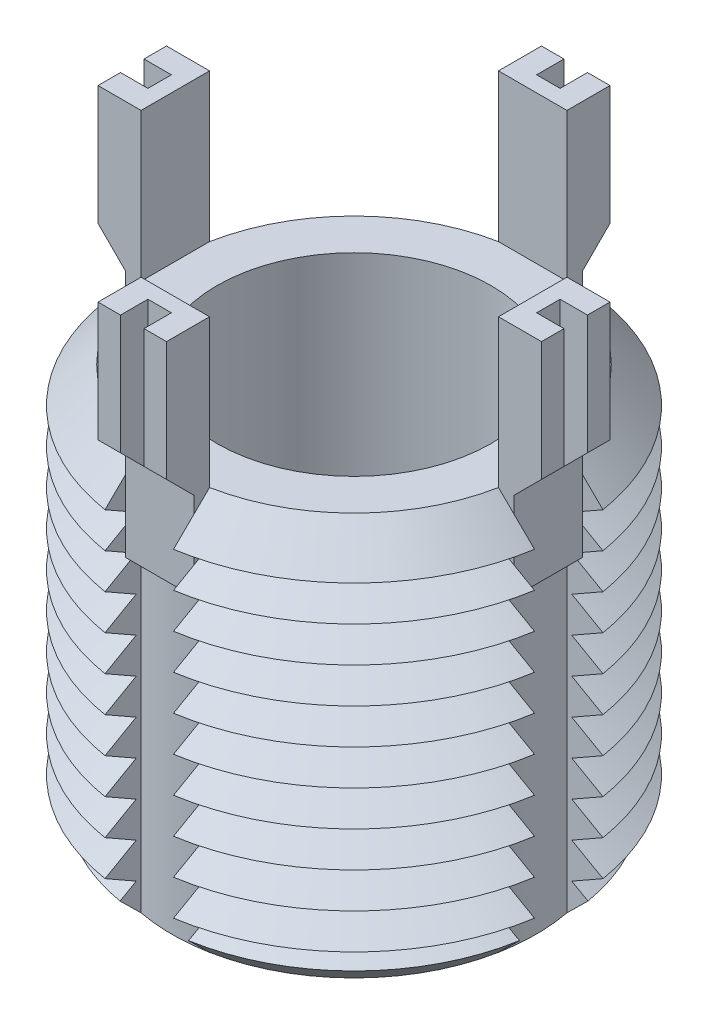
from build123d import *

# Parameters (mm, degrees)
SKETCH1_R           = 11.1125
BOSS_EXTRUDE1_DEPTH = 20.574
CHAMFER1_SIZE       = 1.814
LPATTERN1_COUNT     = 10
LPATTERN1_PITCH     = 1.814
CUT_EXTRUDE1_REACH  = 27.889
CIRPATTERN1_COUNT   = 4
BOSS_EXTRUDE3_DEPTH = 1.75
CIRPATTERN2_COUNT   = 4
CUT_EXTRUDE3_REACH  = 34.377
SKETCH6_W           = 1.4
SKETCH6_H           = 1.2
SKETCH6_W_2         = 1.2
SKETCH6_H_2         = 1.4
SKETCH7_R           = 7
CUT_EXTRUDE4_DEPTH  = 20.574


with BuildPart() as part:
    # Sketch1 → Boss-Extrude1 (new body)
    with BuildSketch(Plane(origin=(0, 0, 0), x_dir=(1, 0, 0), z_dir=(0, 1, 0))):
        with Locations(Location((0, 0, 0), (0, 0, 270))):
            Circle(SKETCH1_R)
    extrude(amount=-BOSS_EXTRUDE1_DEPTH)

    # Chamfer1
    chamfer1_edges = [part.edges().sort_by_distance(p)[0] for p in [
        (0, 0, -11.1125),
        (0, -20.574, -11.1125),
    ]]
    chamfer(chamfer1_edges, length=CHAMFER1_SIZE)

    # Sketch3 → Cut-Revolve1 (revolve, cut)
    with BuildSketch(Plane(origin=(0, 0, 0), x_dir=(0, 0, -1), z_dir=(1, 0, 0))):
        Polygon((-11.1125, -1.814), (-9.541529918, -2.721), (-11.1125, -3.628), align=None)
    cut_revolve1 = revolve(axis=Axis((0, 0.885892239, 0), (0, -1, 0)), mode=Mode.SUBTRACT)

    # LPattern1: Cut-Revolve1 ×10
    with Locations(*[(0, -i * LPATTERN1_PITCH, 0) for i in range(1, LPATTERN1_COUNT)]):
        add(cut_revolve1, mode=Mode.SUBTRACT)

    # Cut-Extrude1: up to this cone (the profile starts inside it)
    cut_extrude1_end = Plane(origin=(0, 0, 0), z_dir=(0, 1, 0)).offset(-29.872499) * Cone(1e-06, 88.134, 88.133999, align=(Align.CENTER, Align.CENTER, Align.MIN), mode=Mode.PRIVATE)
    # Sketch4 → Cut-Extrude1 (cut, up to the surface)
    with BuildSketch(Plane(origin=(0, 0, 0), x_dir=(1, 0, 0), z_dir=(0, 1, 0)), mode=Mode.PRIVATE) as cut_extrude1_sk1:
        with BuildLine():
            Line((-9.132338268, 1.75), (-10.973839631, 1.75))
            ThreePointArc((-10.973839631, 1.75), (-11.1125, 0), (-10.973839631, -1.75))
            Line((-10.973839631, -1.75), (-9.132338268, -1.75))
            ThreePointArc((-9.132338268, -1.75), (-9.2985, 0), (-9.132338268, 1.75))
        make_face()
    cut_extrude1_tool1 = extrude(cut_extrude1_sk1.sketch, amount=-CUT_EXTRUDE1_REACH, mode=Mode.PRIVATE) & cut_extrude1_end
    cut_extrude1 = cut_extrude1_tool1.solids().sort_by_distance((-10.154651, 0, 0))[0]
    add(cut_extrude1, mode=Mode.SUBTRACT)

    # CirPattern1: Cut-Extrude1 ×4 about axis
    cirpattern1_axis = Axis((0, 0, 0), (0, 1, 0))
    for i in range(1, CIRPATTERN1_COUNT):
        add(cut_extrude1.rotate(cirpattern1_axis, i * 360 / CIRPATTERN1_COUNT), mode=Mode.SUBTRACT)

    # Sketch5 → Boss-Extrude3 (add, symmetric)
    with BuildSketch(Plane(origin=(0, 0, 0), x_dir=(0, 0, -1), z_dir=(1, 0, 0))):
        Polygon((-9.132338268, 7.558), (-9.132338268, -4.442), (-9.932338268, -4.442), (-9.932338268, 0.058), (-11.332338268, 1.458), (-11.332338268, 7.558), align=None)
    boss_extrude3 = extrude(amount=BOSS_EXTRUDE3_DEPTH, both=True)

    # CirPattern2: Boss-Extrude3 ×4 about axis
    cirpattern2_axis = Axis((0, 0, 0), (0, 1, 0))
    for i in range(1, CIRPATTERN2_COUNT):
        add(boss_extrude3.rotate(cirpattern2_axis, i * 360 / CIRPATTERN2_COUNT))

    # Cut-Extrude3: up to this plane
    cut_extrude3_end = Plane(origin=(-9.932338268, 0.058, 1.75), z_dir=(0.7071067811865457, 0.7071067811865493, -7.406550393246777e-15))
    # Sketch6 → Cut-Extrude3 (cut, up to the surface)
    with BuildSketch(Plane(origin=(0, 7.558, 0), x_dir=(1, 0, 0), z_dir=(0, 1, 0)), mode=Mode.PRIVATE) as cut_extrude3_sk1:
        with Locations((-10.632338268, 0)):
            Rectangle(SKETCH6_W, SKETCH6_H)
    cut_extrude3_tool1 = split(extrude(cut_extrude3_sk1.sketch, amount=-CUT_EXTRUDE3_REACH, mode=Mode.PRIVATE), bisect_by=cut_extrude3_end, keep=Keep.BOTH, mode=Mode.PRIVATE)
    add(cut_extrude3_tool1.solids().sort_by_distance((-10.632338, 7.558, 0))[0], mode=Mode.SUBTRACT)
    # Sketch6 → Cut-Extrude3 (cut, up to the surface)
    with BuildSketch(Plane(origin=(0, 7.558, 0), x_dir=(1, 0, 0), z_dir=(0, 1, 0)), mode=Mode.PRIVATE) as cut_extrude3_sk2:
        with Locations((0, 10.632338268)):
            Rectangle(SKETCH6_W_2, SKETCH6_H_2)
    cut_extrude3_tool2 = split(extrude(cut_extrude3_sk2.sketch, amount=-CUT_EXTRUDE3_REACH, mode=Mode.PRIVATE), bisect_by=cut_extrude3_end, keep=Keep.BOTH, mode=Mode.PRIVATE)
    add(cut_extrude3_tool2.solids().sort_by_distance((0, 7.558, -10.632338))[0], mode=Mode.SUBTRACT)
    # Sketch6 → Cut-Extrude3 (cut, up to the surface)
    with BuildSketch(Plane(origin=(0, 7.558, 0), x_dir=(1, 0, 0), z_dir=(0, 1, 0)), mode=Mode.PRIVATE) as cut_extrude3_sk3:
        with Locations((10.632338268, 0)):
            Rectangle(SKETCH6_W, SKETCH6_H)
    cut_extrude3_tool3 = split(extrude(cut_extrude3_sk3.sketch, amount=-CUT_EXTRUDE3_REACH, mode=Mode.PRIVATE), bisect_by=cut_extrude3_end, keep=Keep.BOTH, mode=Mode.PRIVATE)
    add(cut_extrude3_tool3.solids().sort_by_distance((10.632338, 7.558, 0))[0], mode=Mode.SUBTRACT)
    # Sketch6 → Cut-Extrude3 (cut, up to the surface)
    with BuildSketch(Plane(origin=(0, 7.558, 0), x_dir=(1, 0, 0), z_dir=(0, 1, 0)), mode=Mode.PRIVATE) as cut_extrude3_sk4:
        with Locations((0, -10.632338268)):
            Rectangle(SKETCH6_W_2, SKETCH6_H_2)
    cut_extrude3_tool4 = split(extrude(cut_extrude3_sk4.sketch, amount=-CUT_EXTRUDE3_REACH, mode=Mode.PRIVATE), bisect_by=cut_extrude3_end, keep=Keep.BOTH, mode=Mode.PRIVATE)
    add(cut_extrude3_tool4.solids().sort_by_distance((0, 7.558, 10.632338))[0], mode=Mode.SUBTRACT)

    # Sketch7 → Cut-Extrude4 (cut)
    with BuildSketch(Plane(origin=(0, 0, 0), x_dir=(1, 0, 0), z_dir=(0, 1, 0))):
        with Locations(Location((0, 0, 0), (0, 0, 270))):
            Circle(SKETCH7_R)
    extrude(amount=-CUT_EXTRUDE4_DEPTH, mode=Mode.SUBTRACT)


solid = part.part
